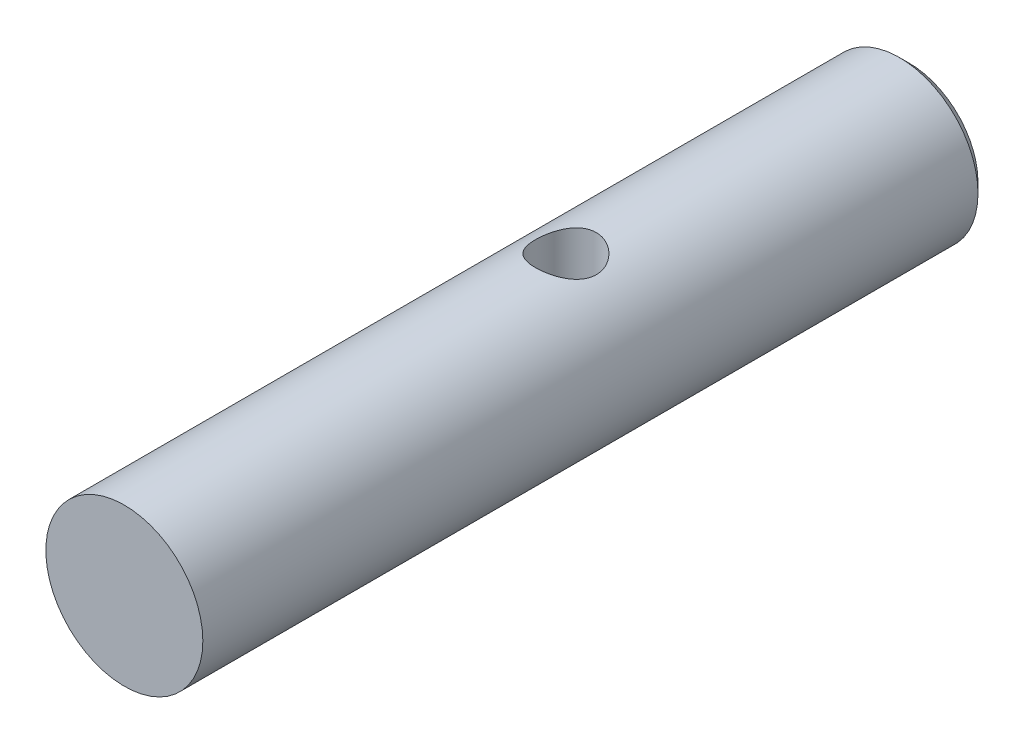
from build123d import *

# Parameters (mm, degrees)
ESQUISSE1_R                  = 4
BASE_EXTRUSION_DEPTH         = 40
CHANFREIN1_SIZE              = 0.5
ENL_V_MAT_EXTRU_1_DEPTH      = 41.398019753
ENL_V_MAT_EXTRU_1_DEPTH_BACK = 41.398019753
ESQUISSE2_R                  = 1.55


with BuildPart() as part:
    # Esquisse1 → Base-Extrusion (new body)
    with BuildSketch(Plane.XY):
        Circle(ESQUISSE1_R)
    extrude(amount=BASE_EXTRUSION_DEPTH)

    # Chanfrein1
    chanfrein1_edges = [part.edges().sort_by_distance(p)[0] for p in [
        (-4, 0, 0),
    ]]
    chamfer(chanfrein1_edges, length=CHANFREIN1_SIZE)

    # Esquisse2 → Enl_v. mat.-Extru.1 (cut, two sides: drawn at the far end of the back side and taken through both)
    with BuildSketch(Plane(origin=(0, 0, 0), x_dir=(1, 0, 0), z_dir=(0, 1, 0)).offset(-ENL_V_MAT_EXTRU_1_DEPTH_BACK)):
        with Locations(Location((0, -17.5, 0), (0, 0, 270))):
            Circle(ESQUISSE2_R)
    extrude(amount=ENL_V_MAT_EXTRU_1_DEPTH + ENL_V_MAT_EXTRU_1_DEPTH_BACK, mode=Mode.SUBTRACT)


solid = part.part
